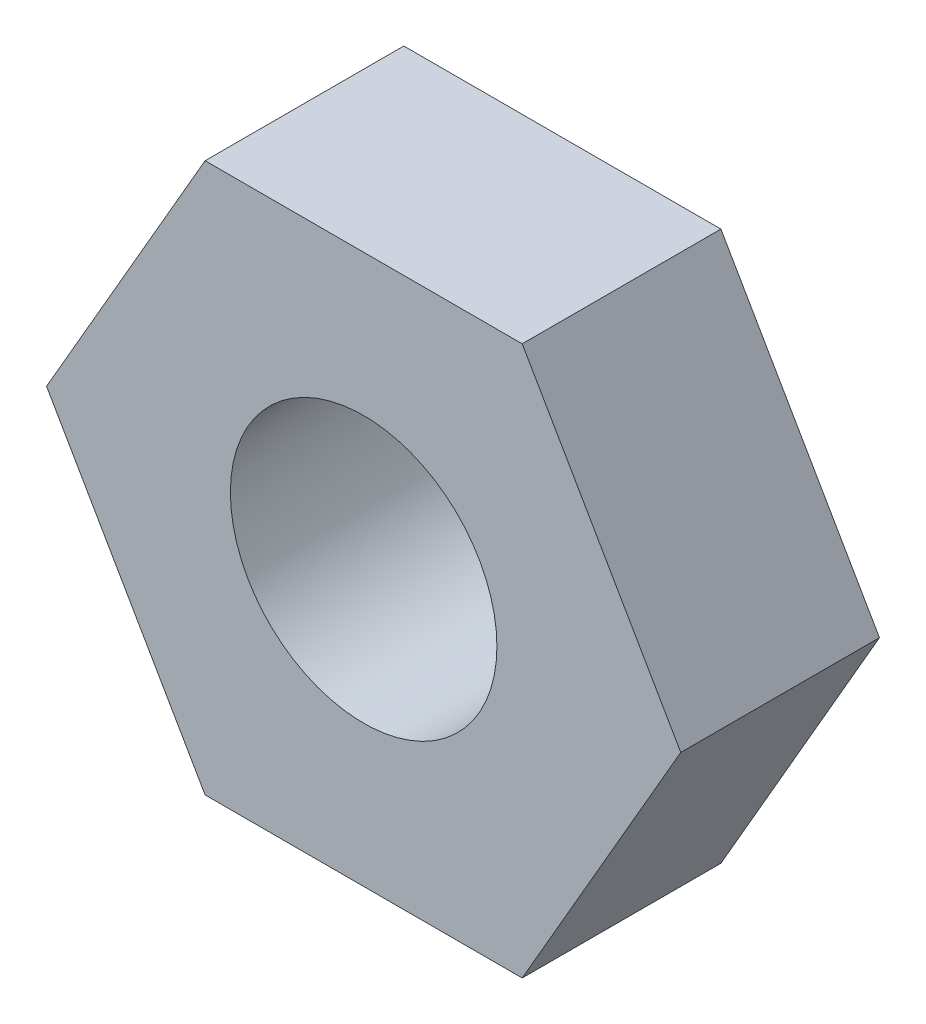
ISO-10303-21;
HEADER;
FILE_DESCRIPTION(('STEP AP214'),'2;1');
FILE_NAME('part.step','',(''),(''),'','','');
FILE_SCHEMA(('AUTOMOTIVE_DESIGN { 1 0 10303 214 1 1 1 1 }'));
ENDSEC;
DATA;
#1=APPLICATION_CONTEXT('core data for automotive mechanical design processes');
#2=APPLICATION_PROTOCOL_DEFINITION('international standard','automotive_design',2000,#1);
#3=PRODUCT_CONTEXT('',#1,'mechanical');
#4=PRODUCT('Part','Part','',(#3));
#5=PRODUCT_RELATED_PRODUCT_CATEGORY('part','',(#4));
#6=PRODUCT_DEFINITION_FORMATION('','',#4);
#7=PRODUCT_DEFINITION_CONTEXT('part definition',#1,'design');
#8=PRODUCT_DEFINITION('design','',#6,#7);
#9=PRODUCT_DEFINITION_SHAPE('','',#8);
#10=(LENGTH_UNIT() NAMED_UNIT(*) SI_UNIT(.MILLI.,.METRE.));
#11=(NAMED_UNIT(*) PLANE_ANGLE_UNIT() SI_UNIT($,.RADIAN.));
#12=(NAMED_UNIT(*) SI_UNIT($,.STERADIAN.) SOLID_ANGLE_UNIT());
#13=UNCERTAINTY_MEASURE_WITH_UNIT(LENGTH_MEASURE(1.E-05),#10,'distance_accuracy_value','');
#14=(GEOMETRIC_REPRESENTATION_CONTEXT(3) GLOBAL_UNCERTAINTY_ASSIGNED_CONTEXT((#13)) GLOBAL_UNIT_ASSIGNED_CONTEXT((#10,
#11,#12)) REPRESENTATION_CONTEXT('',''));
#15=CARTESIAN_POINT('',(0.,0.,0.));
#16=DIRECTION('',(0.,0.,1.));
#17=DIRECTION('',(1.,0.,0.));
#18=AXIS2_PLACEMENT_3D('',#15,#16,#17);
#19=CARTESIAN_POINT('',(2.4929984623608,-4.318,3.1242));
#20=DIRECTION('',(-0.866025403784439,0.5,0.));
#21=DIRECTION('',(-0.5,-0.866025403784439,0.));
#22=AXIS2_PLACEMENT_3D('',#19,#20,#21);
#23=PLANE('',#22);
#24=DIRECTION('',(0.5,0.866025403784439,0.));
#25=VECTOR('',#24,1.);
#26=CARTESIAN_POINT('',(2.4929984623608,-4.318,0.));
#27=LINE('',#26,#25);
#28=CARTESIAN_POINT('',(2.4929984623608,-4.318,0.));
#29=VERTEX_POINT('',#28);
#30=CARTESIAN_POINT('',(4.98599692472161,0.,0.));
#31=VERTEX_POINT('',#30);
#32=EDGE_CURVE('E116',#29,#31,#27,.T.);
#33=ORIENTED_EDGE('',*,*,#32,.T.);
#34=DIRECTION('',(0.,0.,-1.));
#35=VECTOR('',#34,1.);
#36=CARTESIAN_POINT('',(4.98599692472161,0.,3.1242));
#37=LINE('',#36,#35);
#38=CARTESIAN_POINT('',(4.98599692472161,0.,3.1242));
#39=VERTEX_POINT('',#38);
#40=EDGE_CURVE('E11',#39,#31,#37,.T.);
#41=ORIENTED_EDGE('',*,*,#40,.F.);
#42=DIRECTION('',(0.5,0.866025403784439,0.));
#43=VECTOR('',#42,1.);
#44=CARTESIAN_POINT('',(2.4929984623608,-4.318,3.1242));
#45=LINE('',#44,#43);
#46=CARTESIAN_POINT('',(2.4929984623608,-4.318,3.1242));
#47=VERTEX_POINT('',#46);
#48=EDGE_CURVE('E127',#47,#39,#45,.T.);
#49=ORIENTED_EDGE('',*,*,#48,.F.);
#50=DIRECTION('',(0.,0.,-1.));
#51=VECTOR('',#50,1.);
#52=CARTESIAN_POINT('',(2.4929984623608,-4.318,3.1242));
#53=LINE('',#52,#51);
#54=EDGE_CURVE('E112',#47,#29,#53,.T.);
#55=ORIENTED_EDGE('',*,*,#54,.T.);
#56=EDGE_LOOP('',(#33,#41,#49,#55));
#57=FACE_BOUND('',#56,.T.);
#58=ADVANCED_FACE('F32',(#57),#23,.F.);
#59=CARTESIAN_POINT('',(4.98599692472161,0.,3.1242));
#60=DIRECTION('',(-0.866025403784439,-0.5,0.));
#61=DIRECTION('',(0.5,-0.866025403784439,0.));
#62=AXIS2_PLACEMENT_3D('',#59,#60,#61);
#63=PLANE('',#62);
#64=DIRECTION('',(-0.5,0.866025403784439,0.));
#65=VECTOR('',#64,1.);
#66=CARTESIAN_POINT('',(4.98599692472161,0.,0.));
#67=LINE('',#66,#65);
#68=CARTESIAN_POINT('',(2.4929984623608,4.318,0.));
#69=VERTEX_POINT('',#68);
#70=EDGE_CURVE('E119',#31,#69,#67,.T.);
#71=ORIENTED_EDGE('',*,*,#70,.T.);
#72=DIRECTION('',(0.,0.,-1.));
#73=VECTOR('',#72,1.);
#74=CARTESIAN_POINT('',(2.4929984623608,4.318,3.1242));
#75=LINE('',#74,#73);
#76=CARTESIAN_POINT('',(2.4929984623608,4.318,3.1242));
#77=VERTEX_POINT('',#76);
#78=EDGE_CURVE('E40',#77,#69,#75,.T.);
#79=ORIENTED_EDGE('',*,*,#78,.F.);
#80=DIRECTION('',(-0.5,0.866025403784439,0.));
#81=VECTOR('',#80,1.);
#82=CARTESIAN_POINT('',(4.98599692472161,0.,3.1242));
#83=LINE('',#82,#81);
#84=EDGE_CURVE('E85',#39,#77,#83,.T.);
#85=ORIENTED_EDGE('',*,*,#84,.F.);
#86=ORIENTED_EDGE('',*,*,#40,.T.);
#87=EDGE_LOOP('',(#71,#79,#85,#86));
#88=FACE_BOUND('',#87,.T.);
#89=ADVANCED_FACE('F152',(#88),#63,.F.);
#90=CARTESIAN_POINT('',(2.4929984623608,4.318,3.1242));
#91=DIRECTION('',(0.,-1.,0.));
#92=DIRECTION('',(1.,0.,0.));
#93=AXIS2_PLACEMENT_3D('',#90,#91,#92);
#94=PLANE('',#93);
#95=DIRECTION('',(-1.,0.,0.));
#96=VECTOR('',#95,1.);
#97=CARTESIAN_POINT('',(2.4929984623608,4.318,0.));
#98=LINE('',#97,#96);
#99=CARTESIAN_POINT('',(-2.4929984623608,4.318,0.));
#100=VERTEX_POINT('',#99);
#101=EDGE_CURVE('E122',#69,#100,#98,.T.);
#102=ORIENTED_EDGE('',*,*,#101,.T.);
#103=DIRECTION('',(0.,0.,-1.));
#104=VECTOR('',#103,1.);
#105=CARTESIAN_POINT('',(-2.4929984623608,4.318,3.1242));
#106=LINE('',#105,#104);
#107=CARTESIAN_POINT('',(-2.4929984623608,4.318,3.1242));
#108=VERTEX_POINT('',#107);
#109=EDGE_CURVE('E107',#108,#100,#106,.T.);
#110=ORIENTED_EDGE('',*,*,#109,.F.);
#111=DIRECTION('',(-1.,0.,0.));
#112=VECTOR('',#111,1.);
#113=CARTESIAN_POINT('',(2.4929984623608,4.318,3.1242));
#114=LINE('',#113,#112);
#115=EDGE_CURVE('E98',#77,#108,#114,.T.);
#116=ORIENTED_EDGE('',*,*,#115,.F.);
#117=ORIENTED_EDGE('',*,*,#78,.T.);
#118=EDGE_LOOP('',(#102,#110,#116,#117));
#119=FACE_BOUND('',#118,.T.);
#120=ADVANCED_FACE('F133',(#119),#94,.F.);
#121=CARTESIAN_POINT('',(-2.4929984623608,4.318,3.1242));
#122=DIRECTION('',(0.866025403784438,-0.5,0.));
#123=DIRECTION('',(0.5,0.866025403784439,0.));
#124=AXIS2_PLACEMENT_3D('',#121,#122,#123);
#125=PLANE('',#124);
#126=DIRECTION('',(-0.5,-0.866025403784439,0.));
#127=VECTOR('',#126,1.);
#128=CARTESIAN_POINT('',(-2.4929984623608,4.318,0.));
#129=LINE('',#128,#127);
#130=CARTESIAN_POINT('',(-4.98599692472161,0.,0.));
#131=VERTEX_POINT('',#130);
#132=EDGE_CURVE('E106',#100,#131,#129,.T.);
#133=ORIENTED_EDGE('',*,*,#132,.T.);
#134=DIRECTION('',(0.,0.,-1.));
#135=VECTOR('',#134,1.);
#136=CARTESIAN_POINT('',(-4.98599692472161,0.,3.1242));
#137=LINE('',#136,#135);
#138=CARTESIAN_POINT('',(-4.98599692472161,0.,3.1242));
#139=VERTEX_POINT('',#138);
#140=EDGE_CURVE('E103',#139,#131,#137,.T.);
#141=ORIENTED_EDGE('',*,*,#140,.F.);
#142=DIRECTION('',(-0.5,-0.866025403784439,0.));
#143=VECTOR('',#142,1.);
#144=CARTESIAN_POINT('',(-2.4929984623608,4.318,3.1242));
#145=LINE('',#144,#143);
#146=EDGE_CURVE('E92',#108,#139,#145,.T.);
#147=ORIENTED_EDGE('',*,*,#146,.F.);
#148=ORIENTED_EDGE('',*,*,#109,.T.);
#149=EDGE_LOOP('',(#133,#141,#147,#148));
#150=FACE_BOUND('',#149,.T.);
#151=ADVANCED_FACE('F104',(#150),#125,.F.);
#152=CARTESIAN_POINT('',(-4.98599692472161,0.,3.1242));
#153=DIRECTION('',(0.866025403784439,0.5,0.));
#154=DIRECTION('',(-0.5,0.866025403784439,0.));
#155=AXIS2_PLACEMENT_3D('',#152,#153,#154);
#156=PLANE('',#155);
#157=DIRECTION('',(0.5,-0.866025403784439,0.));
#158=VECTOR('',#157,1.);
#159=CARTESIAN_POINT('',(-4.98599692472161,0.,0.));
#160=LINE('',#159,#158);
#161=CARTESIAN_POINT('',(-2.49299846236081,-4.318,0.));
#162=VERTEX_POINT('',#161);
#163=EDGE_CURVE('E71',#131,#162,#160,.T.);
#164=ORIENTED_EDGE('',*,*,#163,.T.);
#165=DIRECTION('',(0.,0.,-1.));
#166=VECTOR('',#165,1.);
#167=CARTESIAN_POINT('',(-2.49299846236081,-4.318,3.1242));
#168=LINE('',#167,#166);
#169=CARTESIAN_POINT('',(-2.49299846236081,-4.318,3.1242));
#170=VERTEX_POINT('',#169);
#171=EDGE_CURVE('E108',#170,#162,#168,.T.);
#172=ORIENTED_EDGE('',*,*,#171,.F.);
#173=DIRECTION('',(0.5,-0.866025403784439,0.));
#174=VECTOR('',#173,1.);
#175=CARTESIAN_POINT('',(-4.98599692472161,0.,3.1242));
#176=LINE('',#175,#174);
#177=EDGE_CURVE('E96',#139,#170,#176,.T.);
#178=ORIENTED_EDGE('',*,*,#177,.F.);
#179=ORIENTED_EDGE('',*,*,#140,.T.);
#180=EDGE_LOOP('',(#164,#172,#178,#179));
#181=FACE_BOUND('',#180,.T.);
#182=ADVANCED_FACE('F110',(#181),#156,.F.);
#183=CARTESIAN_POINT('',(-2.49299846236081,-4.318,3.1242));
#184=DIRECTION('',(0.,1.,0.));
#185=DIRECTION('',(-1.,0.,0.));
#186=AXIS2_PLACEMENT_3D('',#183,#184,#185);
#187=PLANE('',#186);
#188=DIRECTION('',(1.,0.,0.));
#189=VECTOR('',#188,1.);
#190=CARTESIAN_POINT('',(-2.49299846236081,-4.318,0.));
#191=LINE('',#190,#189);
#192=EDGE_CURVE('E77',#162,#29,#191,.T.);
#193=ORIENTED_EDGE('',*,*,#192,.T.);
#194=ORIENTED_EDGE('',*,*,#54,.F.);
#195=DIRECTION('',(1.,0.,0.));
#196=VECTOR('',#195,1.);
#197=CARTESIAN_POINT('',(-2.49299846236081,-4.318,3.1242));
#198=LINE('',#197,#196);
#199=EDGE_CURVE('E48',#170,#47,#198,.T.);
#200=ORIENTED_EDGE('',*,*,#199,.F.);
#201=ORIENTED_EDGE('',*,*,#171,.T.);
#202=EDGE_LOOP('',(#193,#194,#200,#201));
#203=FACE_BOUND('',#202,.T.);
#204=ADVANCED_FACE('F140',(#203),#187,.F.);
#205=CARTESIAN_POINT('',(0.,0.,3.1242));
#206=DIRECTION('',(0.,0.,1.));
#207=DIRECTION('',(1.,0.,0.));
#208=AXIS2_PLACEMENT_3D('',#205,#206,#207);
#209=PLANE('',#208);
#210=CARTESIAN_POINT('',(0.,0.,3.1242));
#211=DIRECTION('',(0.,0.,1.));
#212=DIRECTION('',(1.,0.,0.));
#213=AXIS2_PLACEMENT_3D('',#210,#211,#212);
#214=CIRCLE('',#213,2.0955);
#215=CARTESIAN_POINT('',(2.0955,0.,3.1242));
#216=VERTEX_POINT('',#215);
#217=EDGE_CURVE('E207',#216,#216,#214,.T.);
#218=ORIENTED_EDGE('',*,*,#217,.F.);
#219=EDGE_LOOP('',(#218));
#220=FACE_BOUND('',#219,.T.);
#221=ORIENTED_EDGE('',*,*,#48,.T.);
#222=ORIENTED_EDGE('',*,*,#84,.T.);
#223=ORIENTED_EDGE('',*,*,#115,.T.);
#224=ORIENTED_EDGE('',*,*,#146,.T.);
#225=ORIENTED_EDGE('',*,*,#177,.T.);
#226=ORIENTED_EDGE('',*,*,#199,.T.);
#227=EDGE_LOOP('',(#221,#222,#223,#224,#225,#226));
#228=FACE_BOUND('',#227,.T.);
#229=ADVANCED_FACE('F94',(#220,#228),#209,.T.);
#230=CARTESIAN_POINT('',(0.,0.,0.));
#231=DIRECTION('',(0.,0.,1.));
#232=DIRECTION('',(1.,0.,0.));
#233=AXIS2_PLACEMENT_3D('',#230,#231,#232);
#234=PLANE('',#233);
#235=CARTESIAN_POINT('',(0.,0.,0.));
#236=DIRECTION('',(0.,0.,1.));
#237=DIRECTION('',(1.,0.,0.));
#238=AXIS2_PLACEMENT_3D('',#235,#236,#237);
#239=CIRCLE('',#238,2.0955);
#240=CARTESIAN_POINT('',(2.0955,0.,0.));
#241=VERTEX_POINT('',#240);
#242=EDGE_CURVE('E120',#241,#241,#239,.T.);
#243=ORIENTED_EDGE('',*,*,#242,.T.);
#244=EDGE_LOOP('',(#243));
#245=FACE_BOUND('',#244,.T.);
#246=ORIENTED_EDGE('',*,*,#32,.F.);
#247=ORIENTED_EDGE('',*,*,#192,.F.);
#248=ORIENTED_EDGE('',*,*,#163,.F.);
#249=ORIENTED_EDGE('',*,*,#132,.F.);
#250=ORIENTED_EDGE('',*,*,#101,.F.);
#251=ORIENTED_EDGE('',*,*,#70,.F.);
#252=EDGE_LOOP('',(#246,#247,#248,#249,#250,#251));
#253=FACE_BOUND('',#252,.T.);
#254=ADVANCED_FACE('F136',(#245,#253),#234,.F.);
#255=CARTESIAN_POINT('',(0.,0.,0.));
#256=DIRECTION('',(0.,0.,1.));
#257=DIRECTION('',(1.,0.,0.));
#258=AXIS2_PLACEMENT_3D('',#255,#256,#257);
#259=CYLINDRICAL_SURFACE('',#258,2.0955);
#260=ORIENTED_EDGE('',*,*,#242,.F.);
#261=EDGE_LOOP('',(#260));
#262=FACE_BOUND('',#261,.T.);
#263=ORIENTED_EDGE('',*,*,#217,.T.);
#264=EDGE_LOOP('',(#263));
#265=FACE_BOUND('',#264,.T.);
#266=ADVANCED_FACE('F189',(#262,#265),#259,.F.);
#267=CLOSED_SHELL('',(#58,#89,#120,#151,#182,#204,#229,#254,#266));
#268=MANIFOLD_SOLID_BREP('B2',#267);
#269=ADVANCED_BREP_SHAPE_REPRESENTATION('',(#18,#268),#14);
#270=SHAPE_DEFINITION_REPRESENTATION(#9,#269);
ENDSEC;
END-ISO-10303-21;
